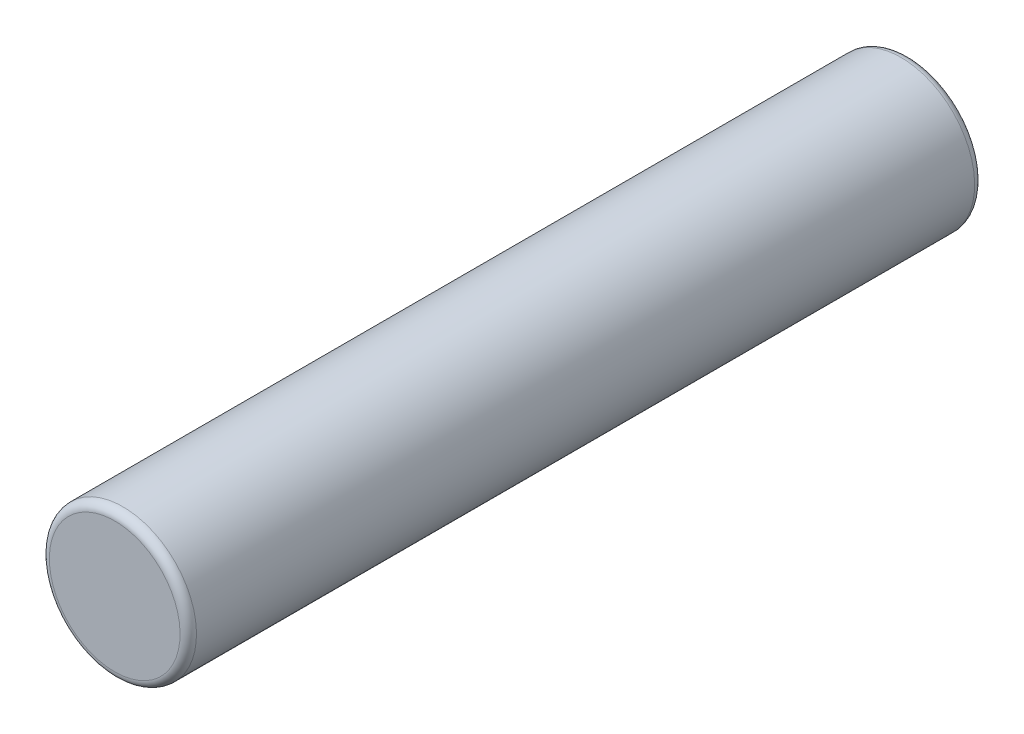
ISO-10303-21;
HEADER;
FILE_DESCRIPTION(('STEP AP214'),'2;1');
FILE_NAME('part.step','',(''),(''),'','','');
FILE_SCHEMA(('AUTOMOTIVE_DESIGN { 1 0 10303 214 1 1 1 1 }'));
ENDSEC;
DATA;
#1=APPLICATION_CONTEXT('core data for automotive mechanical design processes');
#2=APPLICATION_PROTOCOL_DEFINITION('international standard','automotive_design',2000,#1);
#3=PRODUCT_CONTEXT('',#1,'mechanical');
#4=PRODUCT('Part','Part','',(#3));
#5=PRODUCT_RELATED_PRODUCT_CATEGORY('part','',(#4));
#6=PRODUCT_DEFINITION_FORMATION('','',#4);
#7=PRODUCT_DEFINITION_CONTEXT('part definition',#1,'design');
#8=PRODUCT_DEFINITION('design','',#6,#7);
#9=PRODUCT_DEFINITION_SHAPE('','',#8);
#10=(LENGTH_UNIT() NAMED_UNIT(*) SI_UNIT(.MILLI.,.METRE.));
#11=(NAMED_UNIT(*) PLANE_ANGLE_UNIT() SI_UNIT($,.RADIAN.));
#12=(NAMED_UNIT(*) SI_UNIT($,.STERADIAN.) SOLID_ANGLE_UNIT());
#13=UNCERTAINTY_MEASURE_WITH_UNIT(LENGTH_MEASURE(1.E-05),#10,'distance_accuracy_value','');
#14=(GEOMETRIC_REPRESENTATION_CONTEXT(3) GLOBAL_UNCERTAINTY_ASSIGNED_CONTEXT((#13)) GLOBAL_UNIT_ASSIGNED_CONTEXT((#10,
#11,#12)) REPRESENTATION_CONTEXT('',''));
#15=CARTESIAN_POINT('',(0.,0.,0.));
#16=DIRECTION('',(0.,0.,1.));
#17=DIRECTION('',(1.,0.,0.));
#18=AXIS2_PLACEMENT_3D('',#15,#16,#17);
#19=CARTESIAN_POINT('',(0.,0.,19.2405));
#20=DIRECTION('',(0.,0.,-1.));
#21=DIRECTION('',(0.,1.,0.));
#22=AXIS2_PLACEMENT_3D('',#19,#20,#21);
#23=PLANE('',#22);
#24=CARTESIAN_POINT('',(0.,0.,19.2405));
#25=DIRECTION('',(0.,0.,1.));
#26=DIRECTION('',(0.,-1.,0.));
#27=AXIS2_PLACEMENT_3D('',#24,#25,#26);
#28=CIRCLE('',#27,3.165475);
#29=CARTESIAN_POINT('',(0.,-3.165475,19.2405));
#30=VERTEX_POINT('',#29);
#31=EDGE_CURVE('E10',#30,#30,#28,.T.);
#32=ORIENTED_EDGE('',*,*,#31,.T.);
#33=EDGE_LOOP('',(#32));
#34=FACE_BOUND('',#33,.T.);
#35=ADVANCED_FACE('F33',(#34),#23,.F.);
#36=CARTESIAN_POINT('',(0.,0.,18.843625));
#37=DIRECTION('',(0.,0.,1.));
#38=DIRECTION('',(0.,-1.,0.));
#39=AXIS2_PLACEMENT_3D('',#36,#37,#38);
#40=TOROIDAL_SURFACE('',#39,3.165475,0.396875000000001);
#41=ORIENTED_EDGE('',*,*,#31,.F.);
#42=EDGE_LOOP('',(#41));
#43=FACE_BOUND('',#42,.T.);
#44=CARTESIAN_POINT('',(0.,0.,18.843625));
#45=DIRECTION('',(0.,0.,1.));
#46=DIRECTION('',(0.,-1.,0.));
#47=AXIS2_PLACEMENT_3D('',#44,#45,#46);
#48=CIRCLE('',#47,3.56235);
#49=CARTESIAN_POINT('',(0.,-3.56235,18.843625));
#50=VERTEX_POINT('',#49);
#51=EDGE_CURVE('E39',#50,#50,#48,.T.);
#52=ORIENTED_EDGE('',*,*,#51,.T.);
#53=EDGE_LOOP('',(#52));
#54=FACE_BOUND('',#53,.T.);
#55=ADVANCED_FACE('F65',(#43,#54),#40,.T.);
#56=CARTESIAN_POINT('',(0.,0.,19.2405));
#57=DIRECTION('',(0.,0.,1.));
#58=DIRECTION('',(0.,-1.,0.));
#59=AXIS2_PLACEMENT_3D('',#56,#57,#58);
#60=CYLINDRICAL_SURFACE('',#59,3.56235);
#61=ORIENTED_EDGE('',*,*,#51,.F.);
#62=EDGE_LOOP('',(#61));
#63=FACE_BOUND('',#62,.T.);
#64=CARTESIAN_POINT('',(0.,0.,-18.843625));
#65=DIRECTION('',(0.,0.,1.));
#66=DIRECTION('',(0.,-1.,0.));
#67=AXIS2_PLACEMENT_3D('',#64,#65,#66);
#68=CIRCLE('',#67,3.56235000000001);
#69=CARTESIAN_POINT('',(0.,-3.56235000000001,-18.843625));
#70=VERTEX_POINT('',#69);
#71=EDGE_CURVE('E43',#70,#70,#68,.T.);
#72=ORIENTED_EDGE('',*,*,#71,.T.);
#73=EDGE_LOOP('',(#72));
#74=FACE_BOUND('',#73,.T.);
#75=ADVANCED_FACE('F61',(#63,#74),#60,.T.);
#76=CARTESIAN_POINT('',(0.,0.,-18.843625));
#77=DIRECTION('',(0.,0.,1.));
#78=DIRECTION('',(0.,-1.,0.));
#79=AXIS2_PLACEMENT_3D('',#76,#77,#78);
#80=TOROIDAL_SURFACE('',#79,3.16547500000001,0.396875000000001);
#81=ORIENTED_EDGE('',*,*,#71,.F.);
#82=EDGE_LOOP('',(#81));
#83=FACE_BOUND('',#82,.T.);
#84=CARTESIAN_POINT('',(0.,0.,-19.2405));
#85=DIRECTION('',(0.,0.,1.));
#86=DIRECTION('',(0.,-1.,0.));
#87=AXIS2_PLACEMENT_3D('',#84,#85,#86);
#88=CIRCLE('',#87,3.16547500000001);
#89=CARTESIAN_POINT('',(0.,-3.16547500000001,-19.2405));
#90=VERTEX_POINT('',#89);
#91=EDGE_CURVE('E47',#90,#90,#88,.T.);
#92=ORIENTED_EDGE('',*,*,#91,.T.);
#93=EDGE_LOOP('',(#92));
#94=FACE_BOUND('',#93,.T.);
#95=ADVANCED_FACE('F53',(#83,#94),#80,.T.);
#96=CARTESIAN_POINT('',(0.,0.,-19.2405));
#97=DIRECTION('',(0.,0.,1.));
#98=DIRECTION('',(0.,-1.,0.));
#99=AXIS2_PLACEMENT_3D('',#96,#97,#98);
#100=PLANE('',#99);
#101=ORIENTED_EDGE('',*,*,#91,.F.);
#102=EDGE_LOOP('',(#101));
#103=FACE_BOUND('',#102,.T.);
#104=ADVANCED_FACE('F55',(#103),#100,.F.);
#105=CLOSED_SHELL('',(#35,#55,#75,#95,#104));
#106=MANIFOLD_SOLID_BREP('B2',#105);
#107=ADVANCED_BREP_SHAPE_REPRESENTATION('',(#18,#106),#14);
#108=SHAPE_DEFINITION_REPRESENTATION(#9,#107);
ENDSEC;
END-ISO-10303-21;
